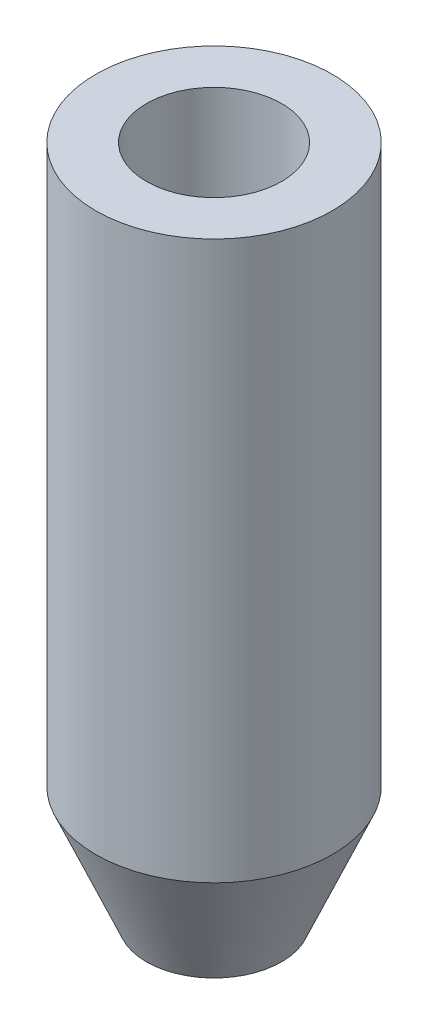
from build123d import *

# Parameters (mm, degrees)
SKETCH1_R               = 3.5
BOSS_EXTRUDE1_DEPTH     = 10
CHAMFER1_SIZE           = 1.5
CHAMFER1_SIZE2          = 3.5
CUT_EXTRUDE1_DEPTH      = 21.603397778
CUT_EXTRUDE1_DEPTH_BACK = 21.603397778
SKETCH2_R               = 0.875
SKETCH3_R               = 1.35
CUT_EXTRUDE2_DEPTH      = 3.5
SKETCH4_R               = 2
CUT_EXTRUDE3_DEPTH      = 5


with BuildPart() as part:
    # Sketch1 → Boss-Extrude1 (new, symmetric)
    with BuildSketch(Plane(origin=(0, 0, 0), x_dir=(1, 0, 0), z_dir=(0, 1, 0))):
        with Locations(Location((0, 0, 0), (0, 0, 270))):
            Circle(SKETCH1_R)
    extrude(amount=BOSS_EXTRUDE1_DEPTH, both=True)

    # Chamfer1
    chamfer1_edges = [part.edges().sort_by_distance(p)[0] for p in [
        (0, -10, -3.5),
    ]]
    chamfer1_side = [part.faces().sort_by_distance(p)[0] for p in [
        (0, -10, 0),
    ]]
    chamfer(chamfer1_edges, length=CHAMFER1_SIZE, length2=CHAMFER1_SIZE2, reference=chamfer1_side[0])

    # Sketch2 → Cut-Extrude1 (cut, two sides: drawn at the far end of the back side and taken through both)
    with BuildSketch(Plane.XZ.offset(10).offset(-CUT_EXTRUDE1_DEPTH_BACK)):
        with Locations(Location((0, 0, 0), (0, 0, 270))):
            Circle(SKETCH2_R)
    extrude(amount=CUT_EXTRUDE1_DEPTH + CUT_EXTRUDE1_DEPTH_BACK, mode=Mode.SUBTRACT)

    # Sketch3 → Cut-Extrude2 (cut)
    with BuildSketch(Plane.XZ.offset(10)):
        with Locations(Location((0, 0, 0), (0, 0, 270))):
            Circle(SKETCH3_R)
    extrude(amount=-CUT_EXTRUDE2_DEPTH, mode=Mode.SUBTRACT)

    # Sketch4 → Cut-Extrude3 (cut)
    with BuildSketch(Plane(origin=(0, 10, 0), x_dir=(1, 0, 0), z_dir=(0, 1, 0))):
        with Locations(Location((0, 0, 0), (0, 0, 270))):
            Circle(SKETCH4_R)
    extrude(amount=-CUT_EXTRUDE3_DEPTH, mode=Mode.SUBTRACT)


solid = part.part
